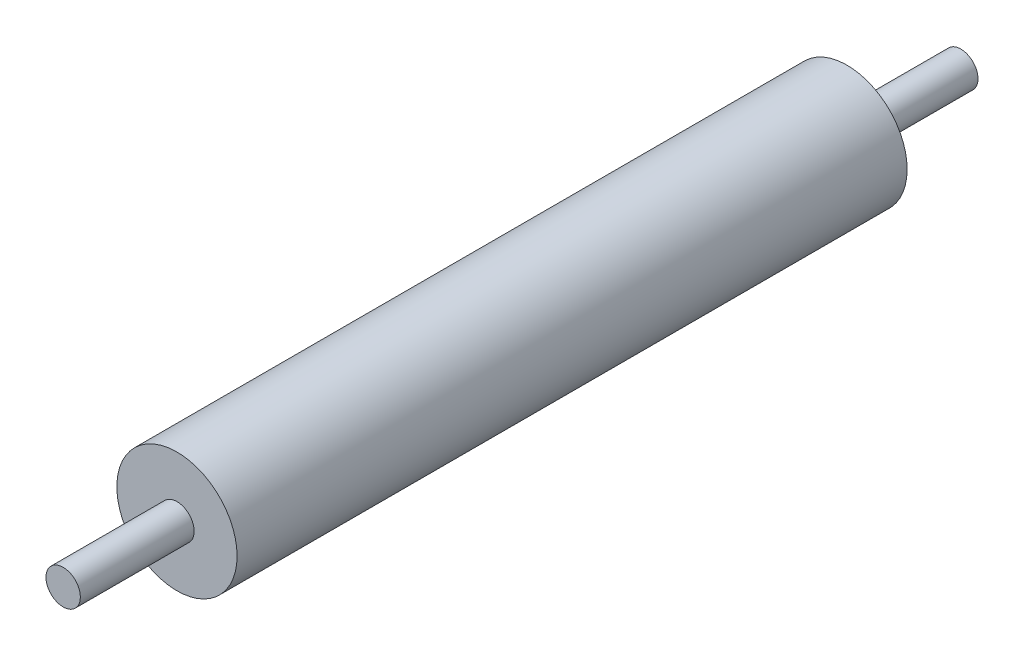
ISO-10303-21;
HEADER;
FILE_DESCRIPTION(('STEP AP214'),'2;1');
FILE_NAME('part.step','',(''),(''),'','','');
FILE_SCHEMA(('AUTOMOTIVE_DESIGN { 1 0 10303 214 1 1 1 1 }'));
ENDSEC;
DATA;
#1=APPLICATION_CONTEXT('core data for automotive mechanical design processes');
#2=APPLICATION_PROTOCOL_DEFINITION('international standard','automotive_design',2000,#1);
#3=PRODUCT_CONTEXT('',#1,'mechanical');
#4=PRODUCT('Part','Part','',(#3));
#5=PRODUCT_RELATED_PRODUCT_CATEGORY('part','',(#4));
#6=PRODUCT_DEFINITION_FORMATION('','',#4);
#7=PRODUCT_DEFINITION_CONTEXT('part definition',#1,'design');
#8=PRODUCT_DEFINITION('design','',#6,#7);
#9=PRODUCT_DEFINITION_SHAPE('','',#8);
#10=(LENGTH_UNIT() NAMED_UNIT(*) SI_UNIT(.MILLI.,.METRE.));
#11=(NAMED_UNIT(*) PLANE_ANGLE_UNIT() SI_UNIT($,.RADIAN.));
#12=(NAMED_UNIT(*) SI_UNIT($,.STERADIAN.) SOLID_ANGLE_UNIT());
#13=UNCERTAINTY_MEASURE_WITH_UNIT(LENGTH_MEASURE(1.E-05),#10,'distance_accuracy_value','');
#14=(GEOMETRIC_REPRESENTATION_CONTEXT(3) GLOBAL_UNCERTAINTY_ASSIGNED_CONTEXT((#13)) GLOBAL_UNIT_ASSIGNED_CONTEXT((#10,
#11,#12)) REPRESENTATION_CONTEXT('',''));
#15=CARTESIAN_POINT('',(0.,0.,0.));
#16=DIRECTION('',(0.,0.,1.));
#17=DIRECTION('',(1.,0.,0.));
#18=AXIS2_PLACEMENT_3D('',#15,#16,#17);
#19=CARTESIAN_POINT('',(0.,0.,-390.));
#20=DIRECTION('',(0.,0.,1.));
#21=DIRECTION('',(1.,0.,0.));
#22=AXIS2_PLACEMENT_3D('',#19,#20,#21);
#23=PLANE('',#22);
#24=CARTESIAN_POINT('',(0.,0.,-390.));
#25=DIRECTION('',(0.,0.,1.));
#26=DIRECTION('',(1.,0.,0.));
#27=AXIS2_PLACEMENT_3D('',#24,#25,#26);
#28=CIRCLE('',#27,70.);
#29=CARTESIAN_POINT('',(70.,0.,-390.));
#30=VERTEX_POINT('',#29);
#31=EDGE_CURVE('E48',#30,#30,#28,.T.);
#32=ORIENTED_EDGE('',*,*,#31,.F.);
#33=EDGE_LOOP('',(#32));
#34=FACE_BOUND('',#33,.T.);
#35=CARTESIAN_POINT('',(0.,0.,-390.));
#36=DIRECTION('',(0.,0.,1.));
#37=DIRECTION('',(1.,0.,0.));
#38=AXIS2_PLACEMENT_3D('',#35,#36,#37);
#39=CIRCLE('',#38,20.);
#40=CARTESIAN_POINT('',(20.,0.,-390.));
#41=VERTEX_POINT('',#40);
#42=EDGE_CURVE('E10',#41,#41,#39,.F.);
#43=ORIENTED_EDGE('',*,*,#42,.F.);
#44=EDGE_LOOP('',(#43));
#45=FACE_BOUND('',#44,.T.);
#46=ADVANCED_FACE('F37',(#34,#45),#23,.F.);
#47=CARTESIAN_POINT('',(0.,0.,390.));
#48=DIRECTION('',(0.,0.,1.));
#49=DIRECTION('',(1.,0.,0.));
#50=AXIS2_PLACEMENT_3D('',#47,#48,#49);
#51=PLANE('',#50);
#52=CARTESIAN_POINT('',(0.,0.,390.));
#53=DIRECTION('',(0.,0.,1.));
#54=DIRECTION('',(1.,0.,0.));
#55=AXIS2_PLACEMENT_3D('',#52,#53,#54);
#56=CIRCLE('',#55,70.);
#57=CARTESIAN_POINT('',(70.,0.,390.));
#58=VERTEX_POINT('',#57);
#59=EDGE_CURVE('E44',#58,#58,#56,.T.);
#60=ORIENTED_EDGE('',*,*,#59,.T.);
#61=EDGE_LOOP('',(#60));
#62=FACE_BOUND('',#61,.T.);
#63=CARTESIAN_POINT('',(0.,0.,390.));
#64=DIRECTION('',(0.,0.,1.));
#65=DIRECTION('',(1.,0.,0.));
#66=AXIS2_PLACEMENT_3D('',#63,#64,#65);
#67=CIRCLE('',#66,20.);
#68=CARTESIAN_POINT('',(20.,0.,390.));
#69=VERTEX_POINT('',#68);
#70=EDGE_CURVE('E57',#69,#69,#67,.T.);
#71=ORIENTED_EDGE('',*,*,#70,.F.);
#72=EDGE_LOOP('',(#71));
#73=FACE_BOUND('',#72,.T.);
#74=ADVANCED_FACE('F79',(#62,#73),#51,.T.);
#75=CARTESIAN_POINT('',(0.,0.,390.));
#76=DIRECTION('',(0.,0.,-1.));
#77=DIRECTION('',(-1.,0.,0.));
#78=AXIS2_PLACEMENT_3D('',#75,#76,#77);
#79=CYLINDRICAL_SURFACE('',#78,70.);
#80=ORIENTED_EDGE('',*,*,#59,.F.);
#81=EDGE_LOOP('',(#80));
#82=FACE_BOUND('',#81,.T.);
#83=ORIENTED_EDGE('',*,*,#31,.T.);
#84=EDGE_LOOP('',(#83));
#85=FACE_BOUND('',#84,.T.);
#86=ADVANCED_FACE('F39',(#82,#85),#79,.T.);
#87=CARTESIAN_POINT('',(0.,0.,522.5));
#88=DIRECTION('',(0.,0.,-1.));
#89=DIRECTION('',(-1.,0.,0.));
#90=AXIS2_PLACEMENT_3D('',#87,#88,#89);
#91=CYLINDRICAL_SURFACE('',#90,20.);
#92=CARTESIAN_POINT('',(0.,0.,522.5));
#93=DIRECTION('',(0.,0.,1.));
#94=DIRECTION('',(1.,0.,0.));
#95=AXIS2_PLACEMENT_3D('',#92,#93,#94);
#96=CIRCLE('',#95,20.);
#97=CARTESIAN_POINT('',(20.,0.,522.5));
#98=VERTEX_POINT('',#97);
#99=EDGE_CURVE('E52',#98,#98,#96,.T.);
#100=ORIENTED_EDGE('',*,*,#99,.F.);
#101=EDGE_LOOP('',(#100));
#102=FACE_BOUND('',#101,.T.);
#103=ORIENTED_EDGE('',*,*,#70,.T.);
#104=EDGE_LOOP('',(#103));
#105=FACE_BOUND('',#104,.T.);
#106=ADVANCED_FACE('F76',(#102,#105),#91,.T.);
#107=CARTESIAN_POINT('',(0.,0.,522.5));
#108=DIRECTION('',(0.,0.,1.));
#109=DIRECTION('',(1.,0.,0.));
#110=AXIS2_PLACEMENT_3D('',#107,#108,#109);
#111=PLANE('',#110);
#112=ORIENTED_EDGE('',*,*,#99,.T.);
#113=EDGE_LOOP('',(#112));
#114=FACE_BOUND('',#113,.T.);
#115=ADVANCED_FACE('F68',(#114),#111,.T.);
#116=CARTESIAN_POINT('',(0.,0.,-522.5));
#117=DIRECTION('',(0.,0.,1.));
#118=DIRECTION('',(1.,0.,0.));
#119=AXIS2_PLACEMENT_3D('',#116,#117,#118);
#120=CYLINDRICAL_SURFACE('',#119,20.);
#121=CARTESIAN_POINT('',(0.,0.,-522.5));
#122=DIRECTION('',(0.,0.,-1.));
#123=DIRECTION('',(-1.,0.,0.));
#124=AXIS2_PLACEMENT_3D('',#121,#122,#123);
#125=CIRCLE('',#124,20.);
#126=CARTESIAN_POINT('',(-20.,0.,-522.5));
#127=VERTEX_POINT('',#126);
#128=EDGE_CURVE('E60',#127,#127,#125,.T.);
#129=ORIENTED_EDGE('',*,*,#128,.F.);
#130=EDGE_LOOP('',(#129));
#131=FACE_BOUND('',#130,.T.);
#132=ORIENTED_EDGE('',*,*,#42,.T.);
#133=EDGE_LOOP('',(#132));
#134=FACE_BOUND('',#133,.T.);
#135=ADVANCED_FACE('F66',(#131,#134),#120,.T.);
#136=CARTESIAN_POINT('',(0.,0.,-522.5));
#137=DIRECTION('',(0.,0.,-1.));
#138=DIRECTION('',(-1.,0.,0.));
#139=AXIS2_PLACEMENT_3D('',#136,#137,#138);
#140=PLANE('',#139);
#141=ORIENTED_EDGE('',*,*,#128,.T.);
#142=EDGE_LOOP('',(#141));
#143=FACE_BOUND('',#142,.T.);
#144=ADVANCED_FACE('F64',(#143),#140,.T.);
#145=CLOSED_SHELL('',(#46,#74,#86,#106,#115,#135,#144));
#146=MANIFOLD_SOLID_BREP('B2',#145);
#147=ADVANCED_BREP_SHAPE_REPRESENTATION('',(#18,#146),#14);
#148=SHAPE_DEFINITION_REPRESENTATION(#9,#147);
ENDSEC;
END-ISO-10303-21;
